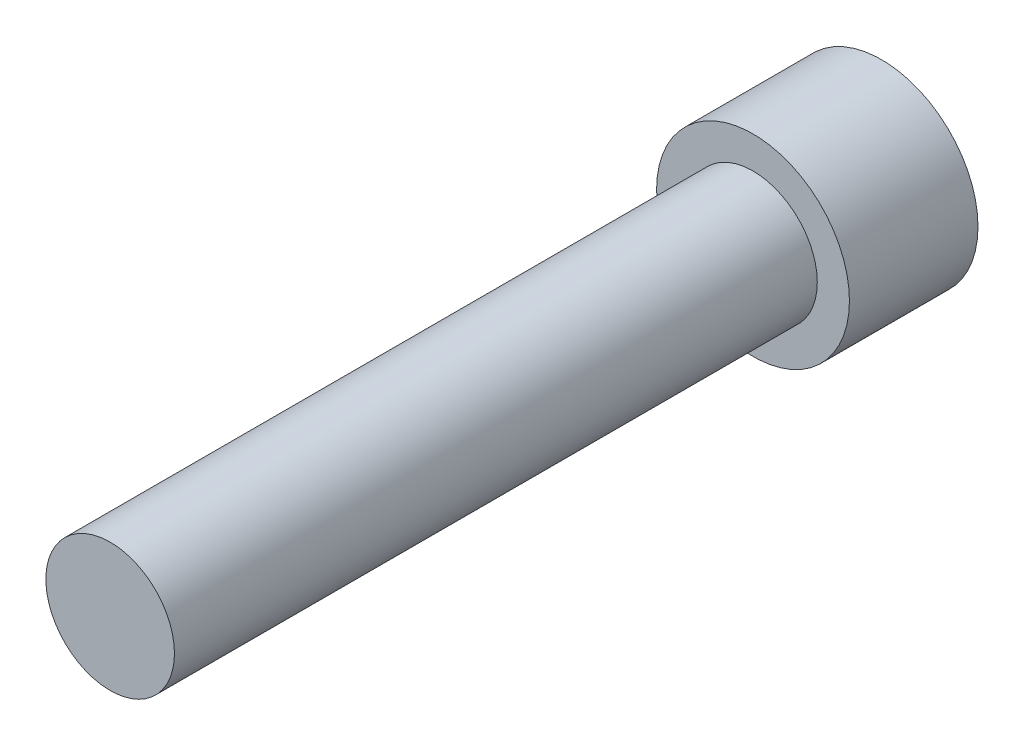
from build123d import *

# Parameters (mm, degrees)
HEX_2_DEPTH = 3.556


with BuildPart() as part:
    # Sketch6 → Revolve1 (revolve)
    with BuildSketch(Plane(origin=(0, 0, 0), x_dir=(0, 0, -1), z_dir=(1, 0, 0)), mode=Mode.PRIVATE) as revolve1_sk:
        Polygon((-31.75, 0), (-31.75, -3.175), (0, -3.175), (0, -4.7625), (6.35, -4.7625), (6.35, 0), align=None)
    revolve(revolve1_sk.sketch.rotate(Axis((0, 0, 31.75), (0, 0, -1)), 270), axis=Axis((0, 0, 31.75), (0, 0, -1)))

    # Sketch7 → HEX 2 (cut)
    with BuildSketch(Plane(origin=(0, 0, -6.35), x_dir=(-1, 0, 0), z_dir=(0, 0, -1))):
        Polygon((-2.3876, 1.378481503), (-2.3876, -1.378481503), (0, -2.756963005), (2.3876, -1.378481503), (2.3876, 1.378481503), (0, 2.756963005), align=None)
    extrude(amount=-HEX_2_DEPTH, mode=Mode.SUBTRACT)


solid = part.part
